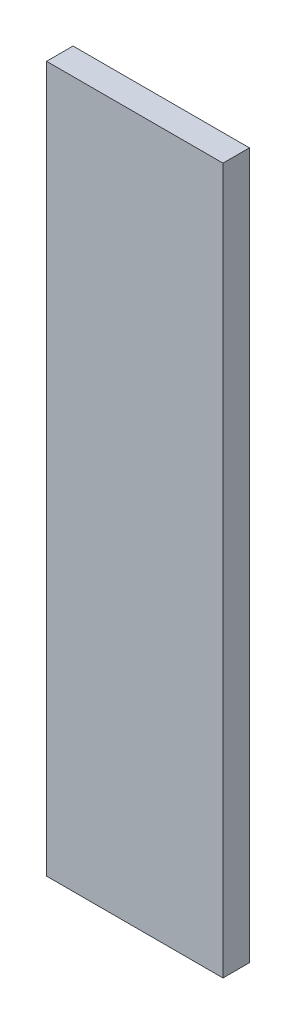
ISO-10303-21;
HEADER;
FILE_DESCRIPTION(('STEP AP214'),'2;1');
FILE_NAME('part.step','',(''),(''),'','','');
FILE_SCHEMA(('AUTOMOTIVE_DESIGN { 1 0 10303 214 1 1 1 1 }'));
ENDSEC;
DATA;
#1=APPLICATION_CONTEXT('core data for automotive mechanical design processes');
#2=APPLICATION_PROTOCOL_DEFINITION('international standard','automotive_design',2000,#1);
#3=PRODUCT_CONTEXT('',#1,'mechanical');
#4=PRODUCT('Part','Part','',(#3));
#5=PRODUCT_RELATED_PRODUCT_CATEGORY('part','',(#4));
#6=PRODUCT_DEFINITION_FORMATION('','',#4);
#7=PRODUCT_DEFINITION_CONTEXT('part definition',#1,'design');
#8=PRODUCT_DEFINITION('design','',#6,#7);
#9=PRODUCT_DEFINITION_SHAPE('','',#8);
#10=(LENGTH_UNIT() NAMED_UNIT(*) SI_UNIT(.MILLI.,.METRE.));
#11=(NAMED_UNIT(*) PLANE_ANGLE_UNIT() SI_UNIT($,.RADIAN.));
#12=(NAMED_UNIT(*) SI_UNIT($,.STERADIAN.) SOLID_ANGLE_UNIT());
#13=UNCERTAINTY_MEASURE_WITH_UNIT(LENGTH_MEASURE(1.E-05),#10,'distance_accuracy_value','');
#14=(GEOMETRIC_REPRESENTATION_CONTEXT(3) GLOBAL_UNCERTAINTY_ASSIGNED_CONTEXT((#13)) GLOBAL_UNIT_ASSIGNED_CONTEXT((#10,
#11,#12)) REPRESENTATION_CONTEXT('',''));
#15=CARTESIAN_POINT('',(0.,0.,0.));
#16=DIRECTION('',(0.,0.,1.));
#17=DIRECTION('',(1.,0.,0.));
#18=AXIS2_PLACEMENT_3D('',#15,#16,#17);
#19=CARTESIAN_POINT('',(0.,60.9022727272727,3.));
#20=DIRECTION('',(1.,0.,0.));
#21=DIRECTION('',(0.,1.,0.));
#22=AXIS2_PLACEMENT_3D('',#19,#20,#21);
#23=PLANE('',#22);
#24=DIRECTION('',(0.,-1.,0.));
#25=VECTOR('',#24,1.);
#26=CARTESIAN_POINT('',(0.,60.9022727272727,0.));
#27=LINE('',#26,#25);
#28=CARTESIAN_POINT('',(0.,60.9022727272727,0.));
#29=VERTEX_POINT('',#28);
#30=CARTESIAN_POINT('',(0.,-19.0977272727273,0.));
#31=VERTEX_POINT('',#30);
#32=EDGE_CURVE('E74',#29,#31,#27,.T.);
#33=ORIENTED_EDGE('',*,*,#32,.T.);
#34=DIRECTION('',(0.,0.,-1.));
#35=VECTOR('',#34,1.);
#36=CARTESIAN_POINT('',(0.,-19.0977272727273,3.));
#37=LINE('',#36,#35);
#38=CARTESIAN_POINT('',(0.,-19.0977272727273,3.));
#39=VERTEX_POINT('',#38);
#40=EDGE_CURVE('E11',#39,#31,#37,.T.);
#41=ORIENTED_EDGE('',*,*,#40,.F.);
#42=DIRECTION('',(0.,-1.,0.));
#43=VECTOR('',#42,1.);
#44=CARTESIAN_POINT('',(0.,60.9022727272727,3.));
#45=LINE('',#44,#43);
#46=CARTESIAN_POINT('',(0.,60.9022727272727,3.));
#47=VERTEX_POINT('',#46);
#48=EDGE_CURVE('E92',#47,#39,#45,.T.);
#49=ORIENTED_EDGE('',*,*,#48,.F.);
#50=DIRECTION('',(0.,0.,-1.));
#51=VECTOR('',#50,1.);
#52=CARTESIAN_POINT('',(0.,60.9022727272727,3.));
#53=LINE('',#52,#51);
#54=EDGE_CURVE('E86',#47,#29,#53,.T.);
#55=ORIENTED_EDGE('',*,*,#54,.T.);
#56=EDGE_LOOP('',(#33,#41,#49,#55));
#57=FACE_BOUND('',#56,.T.);
#58=ADVANCED_FACE('F30',(#57),#23,.F.);
#59=CARTESIAN_POINT('',(0.,-19.0977272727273,3.));
#60=DIRECTION('',(0.,1.,0.));
#61=DIRECTION('',(0.,0.,1.));
#62=AXIS2_PLACEMENT_3D('',#59,#60,#61);
#63=PLANE('',#62);
#64=DIRECTION('',(1.,0.,0.));
#65=VECTOR('',#64,1.);
#66=CARTESIAN_POINT('',(0.,-19.0977272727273,0.));
#67=LINE('',#66,#65);
#68=CARTESIAN_POINT('',(20.,-19.0977272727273,0.));
#69=VERTEX_POINT('',#68);
#70=EDGE_CURVE('E70',#31,#69,#67,.T.);
#71=ORIENTED_EDGE('',*,*,#70,.T.);
#72=DIRECTION('',(0.,0.,-1.));
#73=VECTOR('',#72,1.);
#74=CARTESIAN_POINT('',(20.,-19.0977272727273,3.));
#75=LINE('',#74,#73);
#76=CARTESIAN_POINT('',(20.,-19.0977272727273,3.));
#77=VERTEX_POINT('',#76);
#78=EDGE_CURVE('E37',#77,#69,#75,.T.);
#79=ORIENTED_EDGE('',*,*,#78,.F.);
#80=DIRECTION('',(1.,0.,0.));
#81=VECTOR('',#80,1.);
#82=CARTESIAN_POINT('',(0.,-19.0977272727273,3.));
#83=LINE('',#82,#81);
#84=EDGE_CURVE('E82',#39,#77,#83,.T.);
#85=ORIENTED_EDGE('',*,*,#84,.F.);
#86=ORIENTED_EDGE('',*,*,#40,.T.);
#87=EDGE_LOOP('',(#71,#79,#85,#86));
#88=FACE_BOUND('',#87,.T.);
#89=ADVANCED_FACE('F81',(#88),#63,.F.);
#90=CARTESIAN_POINT('',(20.,60.9022727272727,3.));
#91=DIRECTION('',(-1.,0.,0.));
#92=DIRECTION('',(0.,-1.,0.));
#93=AXIS2_PLACEMENT_3D('',#90,#91,#92);
#94=PLANE('',#93);
#95=DIRECTION('',(0.,1.,0.));
#96=VECTOR('',#95,1.);
#97=CARTESIAN_POINT('',(20.,60.9022727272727,0.));
#98=LINE('',#97,#96);
#99=CARTESIAN_POINT('',(20.,60.9022727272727,0.));
#100=VERTEX_POINT('',#99);
#101=EDGE_CURVE('E75',#69,#100,#98,.T.);
#102=ORIENTED_EDGE('',*,*,#101,.T.);
#103=DIRECTION('',(0.,0.,-1.));
#104=VECTOR('',#103,1.);
#105=CARTESIAN_POINT('',(20.,60.9022727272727,3.));
#106=LINE('',#105,#104);
#107=CARTESIAN_POINT('',(20.,60.9022727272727,3.));
#108=VERTEX_POINT('',#107);
#109=EDGE_CURVE('E98',#108,#100,#106,.T.);
#110=ORIENTED_EDGE('',*,*,#109,.F.);
#111=DIRECTION('',(0.,1.,0.));
#112=VECTOR('',#111,1.);
#113=CARTESIAN_POINT('',(20.,60.9022727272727,3.));
#114=LINE('',#113,#112);
#115=EDGE_CURVE('E49',#77,#108,#114,.T.);
#116=ORIENTED_EDGE('',*,*,#115,.F.);
#117=ORIENTED_EDGE('',*,*,#78,.T.);
#118=EDGE_LOOP('',(#102,#110,#116,#117));
#119=FACE_BOUND('',#118,.T.);
#120=ADVANCED_FACE('F101',(#119),#94,.F.);
#121=CARTESIAN_POINT('',(0.,60.9022727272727,3.));
#122=DIRECTION('',(0.,-1.,0.));
#123=DIRECTION('',(0.,0.,-1.));
#124=AXIS2_PLACEMENT_3D('',#121,#122,#123);
#125=PLANE('',#124);
#126=DIRECTION('',(-1.,0.,0.));
#127=VECTOR('',#126,1.);
#128=CARTESIAN_POINT('',(0.,60.9022727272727,0.));
#129=LINE('',#128,#127);
#130=EDGE_CURVE('E90',#100,#29,#129,.T.);
#131=ORIENTED_EDGE('',*,*,#130,.T.);
#132=ORIENTED_EDGE('',*,*,#54,.F.);
#133=DIRECTION('',(-1.,0.,0.));
#134=VECTOR('',#133,1.);
#135=CARTESIAN_POINT('',(0.,60.9022727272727,3.));
#136=LINE('',#135,#134);
#137=EDGE_CURVE('E44',#108,#47,#136,.T.);
#138=ORIENTED_EDGE('',*,*,#137,.F.);
#139=ORIENTED_EDGE('',*,*,#109,.T.);
#140=EDGE_LOOP('',(#131,#132,#138,#139));
#141=FACE_BOUND('',#140,.T.);
#142=ADVANCED_FACE('F103',(#141),#125,.F.);
#143=CARTESIAN_POINT('',(0.,-19.0977272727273,3.));
#144=DIRECTION('',(0.,0.,1.));
#145=DIRECTION('',(1.,0.,0.));
#146=AXIS2_PLACEMENT_3D('',#143,#144,#145);
#147=PLANE('',#146);
#148=ORIENTED_EDGE('',*,*,#48,.T.);
#149=ORIENTED_EDGE('',*,*,#84,.T.);
#150=ORIENTED_EDGE('',*,*,#115,.T.);
#151=ORIENTED_EDGE('',*,*,#137,.T.);
#152=EDGE_LOOP('',(#148,#149,#150,#151));
#153=FACE_BOUND('',#152,.T.);
#154=ADVANCED_FACE('F104',(#153),#147,.T.);
#155=CARTESIAN_POINT('',(0.,-19.0977272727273,0.));
#156=DIRECTION('',(0.,0.,1.));
#157=DIRECTION('',(1.,0.,0.));
#158=AXIS2_PLACEMENT_3D('',#155,#156,#157);
#159=PLANE('',#158);
#160=ORIENTED_EDGE('',*,*,#32,.F.);
#161=ORIENTED_EDGE('',*,*,#130,.F.);
#162=ORIENTED_EDGE('',*,*,#101,.F.);
#163=ORIENTED_EDGE('',*,*,#70,.F.);
#164=EDGE_LOOP('',(#160,#161,#162,#163));
#165=FACE_BOUND('',#164,.T.);
#166=ADVANCED_FACE('F71',(#165),#159,.F.);
#167=CLOSED_SHELL('',(#58,#89,#120,#142,#154,#166));
#168=MANIFOLD_SOLID_BREP('B2',#167);
#169=ADVANCED_BREP_SHAPE_REPRESENTATION('',(#18,#168),#14);
#170=SHAPE_DEFINITION_REPRESENTATION(#9,#169);
ENDSEC;
END-ISO-10303-21;
